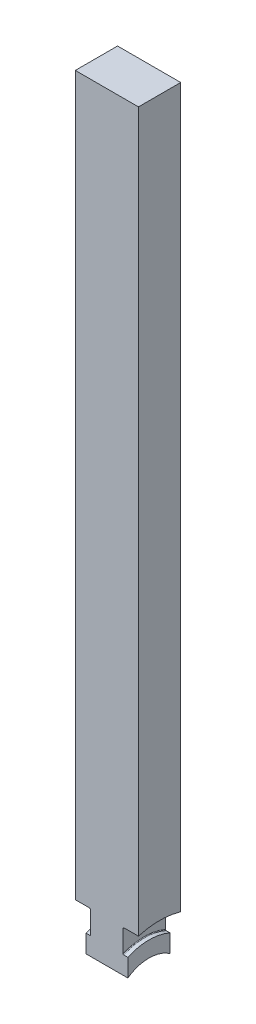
from build123d import *

# Parameters (mm, degrees)
SKETCH1_W               = 25.654
SKETCH1_H               = 479.425
BOSS_EXTRUDE1_DEPTH     = 19.177
CUT_EXTRUDE4_DEPTH      = 480.979811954
CUT_EXTRUDE4_DEPTH_BACK = 480.979811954
SKETCH8_R               = 22.225
SKETCH2_W               = 9.3218
SKETCH2_H               = 13.4874
CUT_EXTRUDE3_DEPTH      = 480.979811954
CUT_EXTRUDE3_DEPTH_BACK = 480.979811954
SKETCH7_W               = 6.477
SKETCH7_H               = 31.75
FILLET1_R               = 0.762
FILLET2_R               = 0.381


with BuildPart() as part:
    # Sketch1 → Boss-Extrude1 (new, symmetric)
    with BuildSketch(Plane(origin=(0, 0, 0), x_dir=(0, 0, -1), z_dir=(1, 0, 0))):
        with Locations((0, 239.7125)):
            Rectangle(SKETCH1_W, SKETCH1_H)
    extrude(amount=BOSS_EXTRUDE1_DEPTH, both=True)

    # Sketch8 → Cut-Extrude4 (cut, two sides: drawn at the far end of the back side and taken through both)
    with BuildSketch(Plane(origin=(0, 0, 0), x_dir=(0, 0, -1), z_dir=(1, 0, 0)).offset(-CUT_EXTRUDE4_DEPTH_BACK)):
        Circle(SKETCH8_R)
    extrude(amount=CUT_EXTRUDE4_DEPTH + CUT_EXTRUDE4_DEPTH_BACK, mode=Mode.SUBTRACT)

    # Sketch2 → Cut-Revolve1 (revolve, cut)
    with BuildSketch(Plane.XY):
        with Locations((14.5161, 38.4937)):
            Rectangle(SKETCH2_W, SKETCH2_H)
        with Locations((-14.5161, 38.4937)):
            Rectangle(SKETCH2_W, SKETCH2_H)
    revolve(axis=Axis((-8.84822894, 0, 0), (1, 0, 0)), mode=Mode.SUBTRACT)

    # Sketch7 → Cut-Extrude3 (cut, two sides: drawn at the far end of the back side and taken through both)
    with BuildSketch(Plane.XY.offset(-CUT_EXTRUDE3_DEPTH_BACK)):
        with Locations((-15.9385, 15.875)):
            Rectangle(SKETCH7_W, SKETCH7_H)
        with Locations((15.9385, 15.875)):
            Rectangle(SKETCH7_W, SKETCH7_H)
    extrude(amount=CUT_EXTRUDE3_DEPTH + CUT_EXTRUDE3_DEPTH_BACK, mode=Mode.SUBTRACT)

    # Fillet1
    fillet1_edges = [part.edges().sort_by_distance(p)[0] for p in [
        (9.8552, 45.2374, 0),
        (-9.8552, 45.2374, 0),
    ]]
    fillet(fillet1_edges, radius=FILLET1_R)

    # Fillet2
    fillet2_edges = [part.edges().sort_by_distance(p)[0] for p in [
        (9.8552, 31.75, 0),
        (-9.8552, 31.75, 0),
    ]]
    fillet(fillet2_edges, radius=FILLET2_R)


solid = part.part
